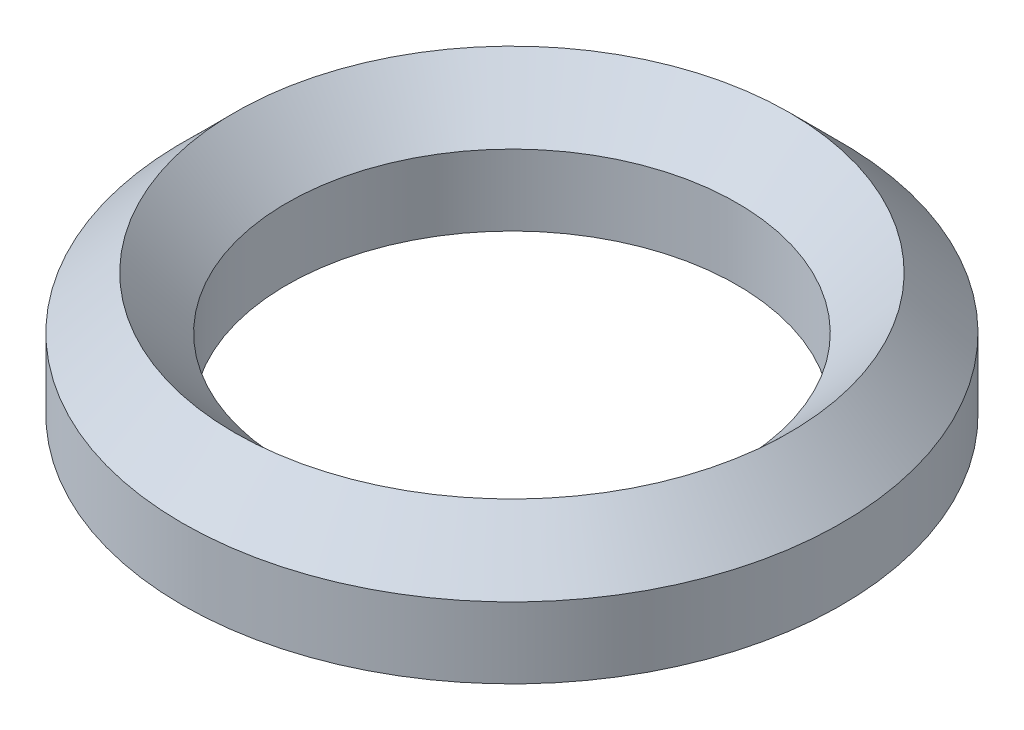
from build123d import *


with BuildPart() as part:
    # Sketch 2 → Revolve 1 (revolve)
    with BuildSketch(Plane(origin=(0, 0, 0), x_dir=(0, 0, -1), z_dir=(1, 0, 0)), mode=Mode.PRIVATE) as revolve_1_sk:
        Polygon((11.1, -6.075), (13.675, -3.5), (16.25, -6.075), (16.25, -2.575), (13.675, 0), (11.1, -2.575), align=None)
    revolve(revolve_1_sk.sketch.rotate(Axis((0, 3.319085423, 0), (0, -1, 0)), 180), axis=Axis((0, 3.319085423, 0), (0, -1, 0)))


solid = part.part
